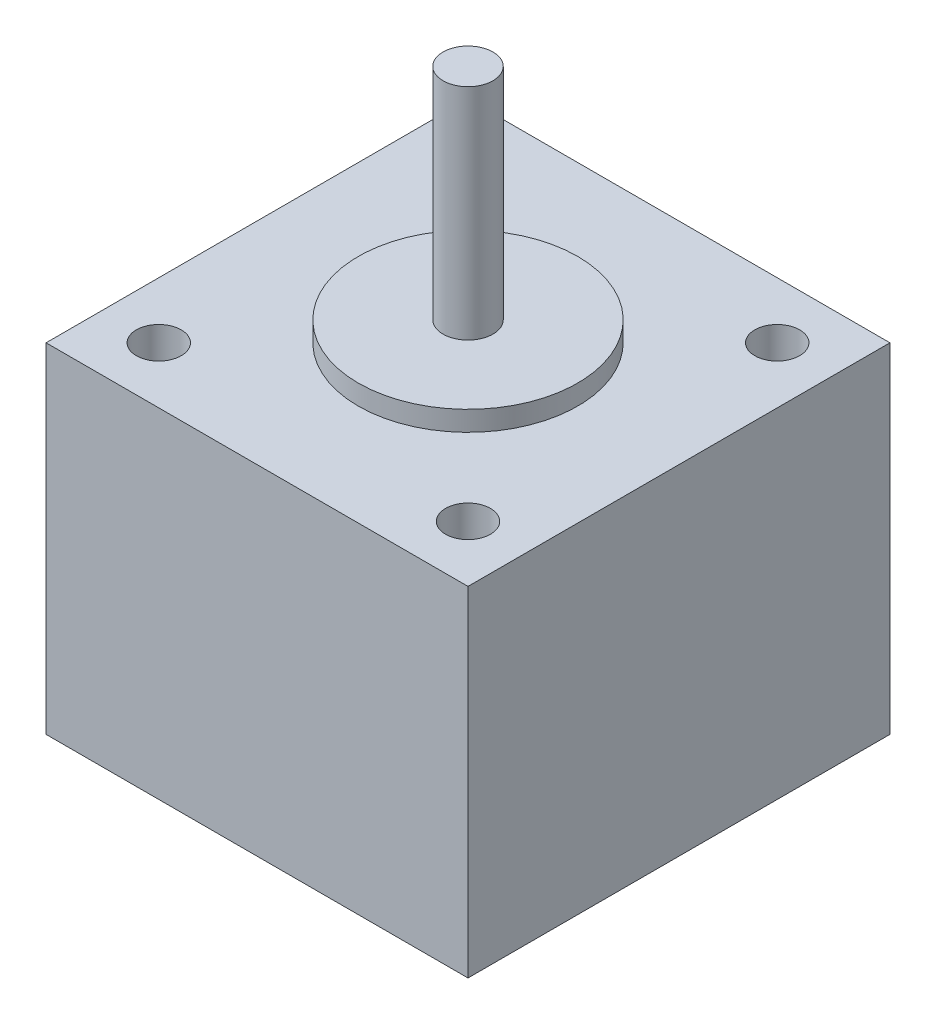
from build123d import *

# Parameters (mm, degrees)
SKETCH1_W           = 42.3
SKETCH1_H           = 42.3
BOSS_EXTRUDE1_DEPTH = 34
SKETCH2_R           = 11
BOSS_EXTRUDE2_DEPTH = 2
SKETCH4_R           = 2.5
BOSS_EXTRUDE3_DEPTH = 22
SKETCH5_R           = 2.25
CUT_EXTRUDE2_DEPTH  = 4


with BuildPart() as part:
    # Sketch1 → Boss-Extrude1 (new body)
    with BuildSketch(Plane(origin=(0, 0, 0), x_dir=(1, 0, 0), z_dir=(0, 1, 0))):
        with Locations((-53.883684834, -7.412011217)):
            Rectangle(SKETCH1_W, SKETCH1_H)
    extrude(amount=BOSS_EXTRUDE1_DEPTH)

    # Sketch2 → Boss-Extrude2 (add)
    with BuildSketch(Plane(origin=(0, 34, 0), x_dir=(-1, 0, 0), z_dir=(0, 1, 0))):
        with Locations(Location((53.883684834, 7.412011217, 0), (0, 0, 90))):
            Circle(SKETCH2_R)
    extrude(amount=BOSS_EXTRUDE2_DEPTH)

    # Sketch4 → Boss-Extrude3 (add)
    with BuildSketch(Plane(origin=(0, 36, 0), x_dir=(-1, 0, 0), z_dir=(0, 1, 0))):
        with Locations(Location((53.883684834, 7.412011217, 0), (0, 0, 90))):
            Circle(SKETCH4_R)
    extrude(amount=BOSS_EXTRUDE3_DEPTH)

    # Sketch5 → Cut-Extrude2 (cut)
    with BuildSketch(Plane(origin=(0, 34, 0), x_dir=(-1, 0, 0), z_dir=(0, 1, 0))):
        with Locations(Location((69.383684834, -8.087988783, 0), (0, 0, 90))):
            Circle(SKETCH5_R)
        with Locations(Location((38.383684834, -8.087988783, 0), (0, 0, 90))):
            Circle(SKETCH5_R)
        with Locations(Location((38.383684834, 22.912011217, 0), (0, 0, 90))):
            Circle(SKETCH5_R)
        with Locations(Location((69.383684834, 22.912011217, 0), (0, 0, 90))):
            Circle(SKETCH5_R)
    extrude(amount=-CUT_EXTRUDE2_DEPTH, mode=Mode.SUBTRACT)


solid = part.part
